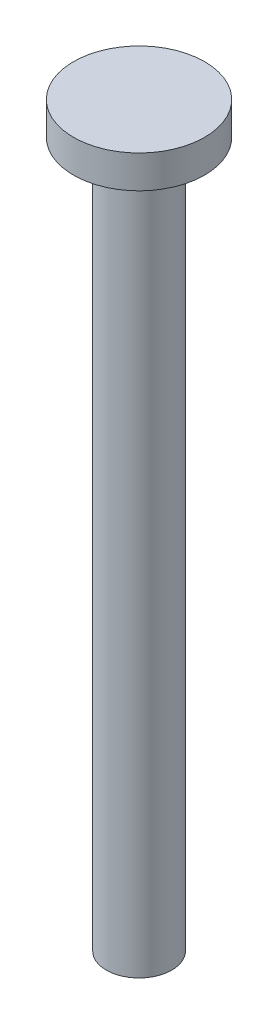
ISO-10303-21;
HEADER;
FILE_DESCRIPTION(('STEP AP214'),'2;1');
FILE_NAME('part.step','',(''),(''),'','','');
FILE_SCHEMA(('AUTOMOTIVE_DESIGN { 1 0 10303 214 1 1 1 1 }'));
ENDSEC;
DATA;
#1=APPLICATION_CONTEXT('core data for automotive mechanical design processes');
#2=APPLICATION_PROTOCOL_DEFINITION('international standard','automotive_design',2000,#1);
#3=PRODUCT_CONTEXT('',#1,'mechanical');
#4=PRODUCT('Part','Part','',(#3));
#5=PRODUCT_RELATED_PRODUCT_CATEGORY('part','',(#4));
#6=PRODUCT_DEFINITION_FORMATION('','',#4);
#7=PRODUCT_DEFINITION_CONTEXT('part definition',#1,'design');
#8=PRODUCT_DEFINITION('design','',#6,#7);
#9=PRODUCT_DEFINITION_SHAPE('','',#8);
#10=(LENGTH_UNIT() NAMED_UNIT(*) SI_UNIT(.MILLI.,.METRE.));
#11=(NAMED_UNIT(*) PLANE_ANGLE_UNIT() SI_UNIT($,.RADIAN.));
#12=(NAMED_UNIT(*) SI_UNIT($,.STERADIAN.) SOLID_ANGLE_UNIT());
#13=UNCERTAINTY_MEASURE_WITH_UNIT(LENGTH_MEASURE(1.E-05),#10,'distance_accuracy_value','');
#14=(GEOMETRIC_REPRESENTATION_CONTEXT(3) GLOBAL_UNCERTAINTY_ASSIGNED_CONTEXT((#13)) GLOBAL_UNIT_ASSIGNED_CONTEXT((#10,
#11,#12)) REPRESENTATION_CONTEXT('',''));
#15=CARTESIAN_POINT('',(0.,0.,0.));
#16=DIRECTION('',(0.,0.,1.));
#17=DIRECTION('',(1.,0.,0.));
#18=AXIS2_PLACEMENT_3D('',#15,#16,#17);
#19=CARTESIAN_POINT('',(-9.33605549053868,39.4001261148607,0.));
#20=DIRECTION('',(0.,-1.,0.));
#21=DIRECTION('',(0.,0.,-1.));
#22=AXIS2_PLACEMENT_3D('',#19,#20,#21);
#23=PLANE('',#22);
#24=CARTESIAN_POINT('',(-9.33605549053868,39.4001261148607,0.));
#25=DIRECTION('',(0.,-1.,0.));
#26=DIRECTION('',(0.,0.,-1.));
#27=AXIS2_PLACEMENT_3D('',#24,#25,#26);
#28=CIRCLE('',#27,8.);
#29=CARTESIAN_POINT('',(-9.33605549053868,39.4001261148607,-8.));
#30=VERTEX_POINT('',#29);
#31=EDGE_CURVE('E10',#30,#30,#28,.T.);
#32=ORIENTED_EDGE('',*,*,#31,.F.);
#33=EDGE_LOOP('',(#32));
#34=FACE_BOUND('',#33,.T.);
#35=ADVANCED_FACE('F31',(#34),#23,.F.);
#36=CARTESIAN_POINT('',(-9.33605549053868,-50.5998738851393,0.));
#37=DIRECTION('',(0.,-1.,0.));
#38=DIRECTION('',(0.,0.,-1.));
#39=AXIS2_PLACEMENT_3D('',#36,#37,#38);
#40=CYLINDRICAL_SURFACE('',#39,8.);
#41=CARTESIAN_POINT('',(-9.33605549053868,35.4001261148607,0.));
#42=DIRECTION('',(0.,-1.,0.));
#43=DIRECTION('',(0.,0.,-1.));
#44=AXIS2_PLACEMENT_3D('',#41,#42,#43);
#45=CIRCLE('',#44,8.);
#46=CARTESIAN_POINT('',(-9.33605549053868,35.4001261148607,-8.));
#47=VERTEX_POINT('',#46);
#48=EDGE_CURVE('E37',#47,#47,#45,.T.);
#49=ORIENTED_EDGE('',*,*,#48,.F.);
#50=EDGE_LOOP('',(#49));
#51=FACE_BOUND('',#50,.T.);
#52=ORIENTED_EDGE('',*,*,#31,.T.);
#53=EDGE_LOOP('',(#52));
#54=FACE_BOUND('',#53,.T.);
#55=ADVANCED_FACE('F61',(#51,#54),#40,.T.);
#56=CARTESIAN_POINT('',(-17.3360554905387,35.4001261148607,0.));
#57=DIRECTION('',(0.,1.,0.));
#58=DIRECTION('',(0.,0.,1.));
#59=AXIS2_PLACEMENT_3D('',#56,#57,#58);
#60=PLANE('',#59);
#61=CARTESIAN_POINT('',(-9.33605549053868,35.4001261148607,0.));
#62=DIRECTION('',(0.,-1.,0.));
#63=DIRECTION('',(0.,0.,-1.));
#64=AXIS2_PLACEMENT_3D('',#61,#62,#63);
#65=CIRCLE('',#64,4.);
#66=CARTESIAN_POINT('',(-9.33605549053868,35.4001261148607,-4.));
#67=VERTEX_POINT('',#66);
#68=EDGE_CURVE('E41',#67,#67,#65,.T.);
#69=ORIENTED_EDGE('',*,*,#68,.F.);
#70=EDGE_LOOP('',(#69));
#71=FACE_BOUND('',#70,.T.);
#72=ORIENTED_EDGE('',*,*,#48,.T.);
#73=EDGE_LOOP('',(#72));
#74=FACE_BOUND('',#73,.T.);
#75=ADVANCED_FACE('F56',(#71,#74),#60,.F.);
#76=CARTESIAN_POINT('',(-9.33605549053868,-50.5998738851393,0.));
#77=DIRECTION('',(0.,-1.,0.));
#78=DIRECTION('',(0.,0.,-1.));
#79=AXIS2_PLACEMENT_3D('',#76,#77,#78);
#80=CYLINDRICAL_SURFACE('',#79,3.99999999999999);
#81=CARTESIAN_POINT('',(-9.33605549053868,-50.5998738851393,0.));
#82=DIRECTION('',(0.,-1.,0.));
#83=DIRECTION('',(0.,0.,-1.));
#84=AXIS2_PLACEMENT_3D('',#81,#82,#83);
#85=CIRCLE('',#84,3.99999999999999);
#86=CARTESIAN_POINT('',(-9.33605549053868,-50.5998738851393,-3.99999999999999));
#87=VERTEX_POINT('',#86);
#88=EDGE_CURVE('E45',#87,#87,#85,.T.);
#89=ORIENTED_EDGE('',*,*,#88,.F.);
#90=EDGE_LOOP('',(#89));
#91=FACE_BOUND('',#90,.T.);
#92=ORIENTED_EDGE('',*,*,#68,.T.);
#93=EDGE_LOOP('',(#92));
#94=FACE_BOUND('',#93,.T.);
#95=ADVANCED_FACE('F53',(#91,#94),#80,.T.);
#96=CARTESIAN_POINT('',(-13.3360554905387,-50.5998738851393,0.));
#97=DIRECTION('',(0.,1.,0.));
#98=DIRECTION('',(0.,0.,1.));
#99=AXIS2_PLACEMENT_3D('',#96,#97,#98);
#100=PLANE('',#99);
#101=ORIENTED_EDGE('',*,*,#88,.T.);
#102=EDGE_LOOP('',(#101));
#103=FACE_BOUND('',#102,.T.);
#104=ADVANCED_FACE('F51',(#103),#100,.F.);
#105=CLOSED_SHELL('',(#35,#55,#75,#95,#104));
#106=MANIFOLD_SOLID_BREP('B2',#105);
#107=ADVANCED_BREP_SHAPE_REPRESENTATION('',(#18,#106),#14);
#108=SHAPE_DEFINITION_REPRESENTATION(#9,#107);
ENDSEC;
END-ISO-10303-21;
